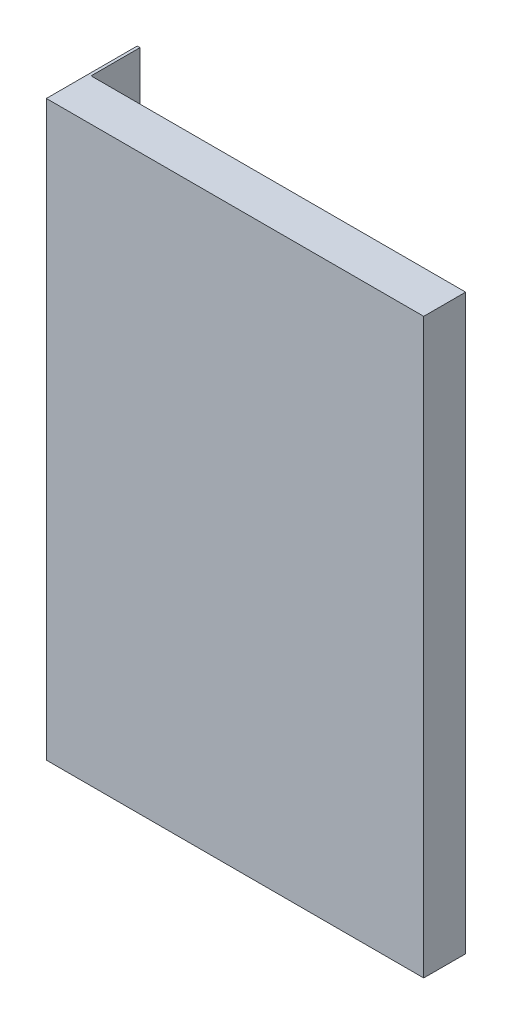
from build123d import *

# Parameters (mm, degrees)
ESQUISSE1_W      = 10
ESQUISSE1_H      = 10
EXTRUSION1_DEPTH = 3.5
ESQUISSE2_W      = 27
ESQUISSE2_H      = 41
EXTRUSION2_DEPTH = 3
ESQUISSE3_W      = 3.5
ESQUISSE3_H      = 41
EXTRUSION3_DEPTH = 0.2


with BuildPart() as part:
    # Esquisse1 → Extrusion1 (new body)
    with BuildSketch(Plane.XY):
        with Locations((-11, -6)):
            Rectangle(ESQUISSE1_W, ESQUISSE1_H)
    extrude(amount=EXTRUSION1_DEPTH)

    # Esquisse2 → Extrusion2 (add)
    with BuildSketch(Plane.XY.offset(3.5)):
        with Locations((-9.5, -5)):
            Rectangle(ESQUISSE2_W, ESQUISSE2_H)
    extrude(amount=EXTRUSION2_DEPTH)

    # Esquisse3 → Extrusion3 (add)
    with BuildSketch(Plane.ZY.offset(23)):
        with Locations((1.75, -5)):
            Rectangle(ESQUISSE3_W, ESQUISSE3_H)
    extrude(amount=-EXTRUSION3_DEPTH)


solid = part.part
